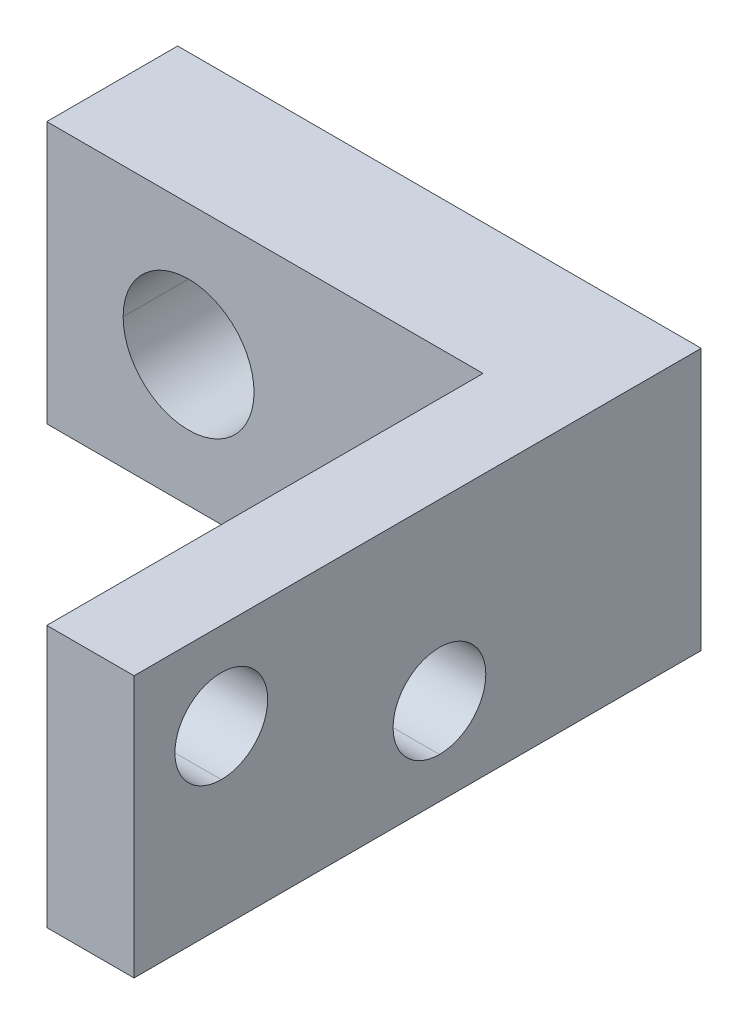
ISO-10303-21;
HEADER;
FILE_DESCRIPTION(('STEP AP214'),'2;1');
FILE_NAME('part.step','',(''),(''),'','','');
FILE_SCHEMA(('AUTOMOTIVE_DESIGN { 1 0 10303 214 1 1 1 1 }'));
ENDSEC;
DATA;
#1=APPLICATION_CONTEXT('core data for automotive mechanical design processes');
#2=APPLICATION_PROTOCOL_DEFINITION('international standard','automotive_design',2000,#1);
#3=PRODUCT_CONTEXT('',#1,'mechanical');
#4=PRODUCT('Part','Part','',(#3));
#5=PRODUCT_RELATED_PRODUCT_CATEGORY('part','',(#4));
#6=PRODUCT_DEFINITION_FORMATION('','',#4);
#7=PRODUCT_DEFINITION_CONTEXT('part definition',#1,'design');
#8=PRODUCT_DEFINITION('design','',#6,#7);
#9=PRODUCT_DEFINITION_SHAPE('','',#8);
#10=(LENGTH_UNIT() NAMED_UNIT(*) SI_UNIT(.MILLI.,.METRE.));
#11=(NAMED_UNIT(*) PLANE_ANGLE_UNIT() SI_UNIT($,.RADIAN.));
#12=(NAMED_UNIT(*) SI_UNIT($,.STERADIAN.) SOLID_ANGLE_UNIT());
#13=UNCERTAINTY_MEASURE_WITH_UNIT(LENGTH_MEASURE(1.E-05),#10,'distance_accuracy_value','');
#14=(GEOMETRIC_REPRESENTATION_CONTEXT(3) GLOBAL_UNCERTAINTY_ASSIGNED_CONTEXT((#13)) GLOBAL_UNIT_ASSIGNED_CONTEXT((#10,
#11,#12)) REPRESENTATION_CONTEXT('',''));
#15=CARTESIAN_POINT('',(0.,0.,0.));
#16=DIRECTION('',(0.,0.,1.));
#17=DIRECTION('',(1.,0.,0.));
#18=AXIS2_PLACEMENT_3D('',#15,#16,#17);
#19=CARTESIAN_POINT('',(-38.1,-19.05,-22.225));
#20=DIRECTION('',(0.,0.,1.));
#21=DIRECTION('',(1.,0.,0.));
#22=AXIS2_PLACEMENT_3D('',#19,#20,#21);
#23=PLANE('',#22);
#24=CARTESIAN_POINT('',(-17.4625,5.41433564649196E-13,-22.225));
#25=DIRECTION('',(0.,0.,1.));
#26=DIRECTION('',(1.,0.,0.));
#27=AXIS2_PLACEMENT_3D('',#24,#25,#26);
#28=CIRCLE('',#27,9.525);
#29=CARTESIAN_POINT('',(-26.9875,5.42600002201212E-13,-22.225));
#30=VERTEX_POINT('',#29);
#31=CARTESIAN_POINT('',(-7.9375,5.41433564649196E-13,-22.225));
#32=VERTEX_POINT('',#31);
#33=EDGE_CURVE('E19',#30,#32,#28,.F.);
#34=ORIENTED_EDGE('',*,*,#33,.T.);
#35=CARTESIAN_POINT('',(-17.4625,5.41433564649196E-13,-22.225));
#36=DIRECTION('',(0.,0.,1.));
#37=DIRECTION('',(1.,0.,0.));
#38=AXIS2_PLACEMENT_3D('',#35,#36,#37);
#39=CIRCLE('',#38,9.525);
#40=EDGE_CURVE('E103',#32,#30,#39,.F.);
#41=ORIENTED_EDGE('',*,*,#40,.T.);
#42=EDGE_LOOP('',(#34,#41));
#43=FACE_BOUND('',#42,.T.);
#44=DIRECTION('',(0.,1.,0.));
#45=VECTOR('',#44,1.);
#46=CARTESIAN_POINT('',(-38.1,-19.05,-22.225));
#47=LINE('',#46,#45);
#48=CARTESIAN_POINT('',(-38.1,-19.05,-22.225));
#49=VERTEX_POINT('',#48);
#50=CARTESIAN_POINT('',(-38.1,19.05,-22.225));
#51=VERTEX_POINT('',#50);
#52=EDGE_CURVE('E118',#49,#51,#47,.T.);
#53=ORIENTED_EDGE('',*,*,#52,.F.);
#54=DIRECTION('',(1.,0.,0.));
#55=VECTOR('',#54,1.);
#56=CARTESIAN_POINT('',(38.1,-19.05,-22.225));
#57=LINE('',#56,#55);
#58=CARTESIAN_POINT('',(25.4,-19.05,-22.225));
#59=VERTEX_POINT('',#58);
#60=EDGE_CURVE('E176',#59,#49,#57,.F.);
#61=ORIENTED_EDGE('',*,*,#60,.F.);
#62=DIRECTION('',(0.,1.,0.));
#63=VECTOR('',#62,1.);
#64=CARTESIAN_POINT('',(25.4,0.,-22.225));
#65=LINE('',#64,#63);
#66=CARTESIAN_POINT('',(25.4,19.05,-22.225));
#67=VERTEX_POINT('',#66);
#68=EDGE_CURVE('E109',#59,#67,#65,.T.);
#69=ORIENTED_EDGE('',*,*,#68,.T.);
#70=DIRECTION('',(1.,0.,0.));
#71=VECTOR('',#70,1.);
#72=CARTESIAN_POINT('',(38.1,19.05,-22.225));
#73=LINE('',#72,#71);
#74=EDGE_CURVE('E167',#67,#51,#73,.F.);
#75=ORIENTED_EDGE('',*,*,#74,.T.);
#76=EDGE_LOOP('',(#53,#61,#69,#75));
#77=FACE_BOUND('',#76,.T.);
#78=ADVANCED_FACE('F16',(#43,#77),#23,.T.);
#79=CARTESIAN_POINT('',(25.4,0.,-3.175));
#80=DIRECTION('',(1.,0.,0.));
#81=DIRECTION('',(0.,0.,-1.));
#82=AXIS2_PLACEMENT_3D('',#79,#80,#81);
#83=PLANE('',#82);
#84=ORIENTED_EDGE('',*,*,#68,.F.);
#85=DIRECTION('',(0.,0.,-1.));
#86=VECTOR('',#85,1.);
#87=CARTESIAN_POINT('',(25.4,-19.05,-41.275));
#88=LINE('',#87,#86);
#89=CARTESIAN_POINT('',(25.4,-19.05,41.275));
#90=VERTEX_POINT('',#89);
#91=EDGE_CURVE('E137',#90,#59,#88,.T.);
#92=ORIENTED_EDGE('',*,*,#91,.F.);
#93=DIRECTION('',(0.,1.,0.));
#94=VECTOR('',#93,1.);
#95=CARTESIAN_POINT('',(25.4,0.,41.275));
#96=LINE('',#95,#94);
#97=CARTESIAN_POINT('',(25.4,19.05,41.275));
#98=VERTEX_POINT('',#97);
#99=EDGE_CURVE('E174',#98,#90,#96,.F.);
#100=ORIENTED_EDGE('',*,*,#99,.F.);
#101=DIRECTION('',(0.,0.,-1.));
#102=VECTOR('',#101,1.);
#103=CARTESIAN_POINT('',(25.4,19.05,-41.275));
#104=LINE('',#103,#102);
#105=EDGE_CURVE('E163',#98,#67,#104,.T.);
#106=ORIENTED_EDGE('',*,*,#105,.T.);
#107=EDGE_LOOP('',(#84,#92,#100,#106));
#108=FACE_BOUND('',#107,.T.);
#109=CARTESIAN_POINT('',(25.4,6.34999999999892,28.575));
#110=DIRECTION('',(-1.,0.,0.));
#111=DIRECTION('',(0.,0.,1.));
#112=AXIS2_PLACEMENT_3D('',#109,#110,#111);
#113=CIRCLE('',#112,6.746875);
#114=CARTESIAN_POINT('',(25.4,13.0968749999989,28.575));
#115=VERTEX_POINT('',#114);
#116=CARTESIAN_POINT('',(25.4,-0.396875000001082,28.575));
#117=VERTEX_POINT('',#116);
#118=EDGE_CURVE('E129',#115,#117,#113,.F.);
#119=ORIENTED_EDGE('',*,*,#118,.T.);
#120=CARTESIAN_POINT('',(25.4,6.34999999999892,28.575));
#121=DIRECTION('',(-1.,0.,0.));
#122=DIRECTION('',(0.,0.,1.));
#123=AXIS2_PLACEMENT_3D('',#120,#121,#122);
#124=CIRCLE('',#123,6.746875);
#125=EDGE_CURVE('E131',#117,#115,#124,.F.);
#126=ORIENTED_EDGE('',*,*,#125,.T.);
#127=EDGE_LOOP('',(#119,#126));
#128=FACE_BOUND('',#127,.T.);
#129=CARTESIAN_POINT('',(25.4,-6.34999999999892,-3.175));
#130=DIRECTION('',(-1.,0.,0.));
#131=DIRECTION('',(0.,0.,1.));
#132=AXIS2_PLACEMENT_3D('',#129,#130,#131);
#133=CIRCLE('',#132,6.746875);
#134=CARTESIAN_POINT('',(25.4,0.396875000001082,-3.175));
#135=VERTEX_POINT('',#134);
#136=CARTESIAN_POINT('',(25.4,-13.0968749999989,-3.175));
#137=VERTEX_POINT('',#136);
#138=EDGE_CURVE('E124',#135,#137,#133,.F.);
#139=ORIENTED_EDGE('',*,*,#138,.T.);
#140=CARTESIAN_POINT('',(25.4,-6.34999999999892,-3.175));
#141=DIRECTION('',(-1.,0.,0.));
#142=DIRECTION('',(0.,0.,1.));
#143=AXIS2_PLACEMENT_3D('',#140,#141,#142);
#144=CIRCLE('',#143,6.746875);
#145=EDGE_CURVE('E126',#137,#135,#144,.F.);
#146=ORIENTED_EDGE('',*,*,#145,.T.);
#147=EDGE_LOOP('',(#139,#146));
#148=FACE_BOUND('',#147,.T.);
#149=ADVANCED_FACE('F207',(#108,#128,#148),#83,.F.);
#150=CARTESIAN_POINT('',(-17.4625,5.41433564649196E-13,-31.75));
#151=DIRECTION('',(0.,0.,1.));
#152=DIRECTION('',(1.,0.,0.));
#153=AXIS2_PLACEMENT_3D('',#150,#151,#152);
#154=CYLINDRICAL_SURFACE('',#153,9.525);
#155=ORIENTED_EDGE('',*,*,#33,.F.);
#156=DIRECTION('',(0.,0.,1.));
#157=VECTOR('',#156,1.);
#158=CARTESIAN_POINT('',(-26.9875,5.42600002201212E-13,-31.75));
#159=LINE('',#158,#157);
#160=CARTESIAN_POINT('',(-26.9875,5.42600002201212E-13,-41.275));
#161=VERTEX_POINT('',#160);
#162=EDGE_CURVE('E119',#30,#161,#159,.F.);
#163=ORIENTED_EDGE('',*,*,#162,.T.);
#164=CARTESIAN_POINT('',(-17.4625,5.41433564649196E-13,-41.275));
#165=DIRECTION('',(0.,0.,1.));
#166=DIRECTION('',(1.,0.,0.));
#167=AXIS2_PLACEMENT_3D('',#164,#165,#166);
#168=CIRCLE('',#167,9.525);
#169=CARTESIAN_POINT('',(-7.9375,5.41433564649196E-13,-41.275));
#170=VERTEX_POINT('',#169);
#171=EDGE_CURVE('E114',#161,#170,#168,.F.);
#172=ORIENTED_EDGE('',*,*,#171,.T.);
#173=DIRECTION('',(0.,0.,1.));
#174=VECTOR('',#173,1.);
#175=CARTESIAN_POINT('',(-7.9375,5.41433564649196E-13,-31.75));
#176=LINE('',#175,#174);
#177=EDGE_CURVE('E111',#170,#32,#176,.T.);
#178=ORIENTED_EDGE('',*,*,#177,.T.);
#179=EDGE_LOOP('',(#155,#163,#172,#178));
#180=FACE_BOUND('',#179,.T.);
#181=ADVANCED_FACE('F112',(#180),#154,.F.);
#182=CARTESIAN_POINT('',(-17.4625,5.41433564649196E-13,-31.75));
#183=DIRECTION('',(0.,0.,1.));
#184=DIRECTION('',(1.,0.,0.));
#185=AXIS2_PLACEMENT_3D('',#182,#183,#184);
#186=CYLINDRICAL_SURFACE('',#185,9.525);
#187=CARTESIAN_POINT('',(-17.4625,5.41433564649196E-13,-41.275));
#188=DIRECTION('',(0.,0.,1.));
#189=DIRECTION('',(1.,0.,0.));
#190=AXIS2_PLACEMENT_3D('',#187,#188,#189);
#191=CIRCLE('',#190,9.525);
#192=EDGE_CURVE('E136',#170,#161,#191,.F.);
#193=ORIENTED_EDGE('',*,*,#192,.T.);
#194=ORIENTED_EDGE('',*,*,#162,.F.);
#195=ORIENTED_EDGE('',*,*,#40,.F.);
#196=ORIENTED_EDGE('',*,*,#177,.F.);
#197=EDGE_LOOP('',(#193,#194,#195,#196));
#198=FACE_BOUND('',#197,.T.);
#199=ADVANCED_FACE('F121',(#198),#186,.F.);
#200=CARTESIAN_POINT('',(-38.1,-19.05,-41.275));
#201=DIRECTION('',(-1.,0.,0.));
#202=DIRECTION('',(0.,0.,1.));
#203=AXIS2_PLACEMENT_3D('',#200,#201,#202);
#204=PLANE('',#203);
#205=DIRECTION('',(0.,0.,-1.));
#206=VECTOR('',#205,1.);
#207=CARTESIAN_POINT('',(-38.1,-19.05,-41.275));
#208=LINE('',#207,#206);
#209=CARTESIAN_POINT('',(-38.1,-19.05,-41.275));
#210=VERTEX_POINT('',#209);
#211=EDGE_CURVE('E179',#49,#210,#208,.T.);
#212=ORIENTED_EDGE('',*,*,#211,.F.);
#213=ORIENTED_EDGE('',*,*,#52,.T.);
#214=DIRECTION('',(0.,0.,-1.));
#215=VECTOR('',#214,1.);
#216=CARTESIAN_POINT('',(-38.1,19.05,-41.275));
#217=LINE('',#216,#215);
#218=CARTESIAN_POINT('',(-38.1,19.05,-41.275));
#219=VERTEX_POINT('',#218);
#220=EDGE_CURVE('E169',#51,#219,#217,.T.);
#221=ORIENTED_EDGE('',*,*,#220,.T.);
#222=DIRECTION('',(0.,1.,0.));
#223=VECTOR('',#222,1.);
#224=CARTESIAN_POINT('',(-38.1,3.175,-41.275));
#225=LINE('',#224,#223);
#226=EDGE_CURVE('E139',#219,#210,#225,.F.);
#227=ORIENTED_EDGE('',*,*,#226,.T.);
#228=EDGE_LOOP('',(#212,#213,#221,#227));
#229=FACE_BOUND('',#228,.T.);
#230=ADVANCED_FACE('F220',(#229),#204,.T.);
#231=CARTESIAN_POINT('',(31.75,-6.34999999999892,-3.175));
#232=DIRECTION('',(-1.,0.,0.));
#233=DIRECTION('',(0.,0.,1.));
#234=AXIS2_PLACEMENT_3D('',#231,#232,#233);
#235=CYLINDRICAL_SURFACE('',#234,6.746875);
#236=ORIENTED_EDGE('',*,*,#138,.F.);
#237=DIRECTION('',(-1.,0.,0.));
#238=VECTOR('',#237,1.);
#239=CARTESIAN_POINT('',(31.75,0.396875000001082,-3.175));
#240=LINE('',#239,#238);
#241=CARTESIAN_POINT('',(38.1,0.396875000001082,-3.175));
#242=VERTEX_POINT('',#241);
#243=EDGE_CURVE('E128',#135,#242,#240,.F.);
#244=ORIENTED_EDGE('',*,*,#243,.T.);
#245=CARTESIAN_POINT('',(38.1,-6.34999999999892,-3.175));
#246=DIRECTION('',(-1.,0.,0.));
#247=DIRECTION('',(0.,0.,1.));
#248=AXIS2_PLACEMENT_3D('',#245,#246,#247);
#249=CIRCLE('',#248,6.746875);
#250=CARTESIAN_POINT('',(38.1,-13.0968749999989,-3.175));
#251=VERTEX_POINT('',#250);
#252=EDGE_CURVE('E140',#251,#242,#249,.T.);
#253=ORIENTED_EDGE('',*,*,#252,.F.);
#254=DIRECTION('',(-1.,0.,0.));
#255=VECTOR('',#254,1.);
#256=CARTESIAN_POINT('',(31.75,-13.0968749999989,-3.175));
#257=LINE('',#256,#255);
#258=EDGE_CURVE('E132',#251,#137,#257,.T.);
#259=ORIENTED_EDGE('',*,*,#258,.T.);
#260=EDGE_LOOP('',(#236,#244,#253,#259));
#261=FACE_BOUND('',#260,.T.);
#262=ADVANCED_FACE('F222',(#261),#235,.F.);
#263=CARTESIAN_POINT('',(31.75,-6.34999999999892,-3.175));
#264=DIRECTION('',(-1.,0.,0.));
#265=DIRECTION('',(0.,0.,1.));
#266=AXIS2_PLACEMENT_3D('',#263,#264,#265);
#267=CYLINDRICAL_SURFACE('',#266,6.746875);
#268=CARTESIAN_POINT('',(38.1,-6.34999999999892,-3.175));
#269=DIRECTION('',(-1.,0.,0.));
#270=DIRECTION('',(0.,0.,1.));
#271=AXIS2_PLACEMENT_3D('',#268,#269,#270);
#272=CIRCLE('',#271,6.746875);
#273=EDGE_CURVE('E143',#242,#251,#272,.T.);
#274=ORIENTED_EDGE('',*,*,#273,.F.);
#275=ORIENTED_EDGE('',*,*,#243,.F.);
#276=ORIENTED_EDGE('',*,*,#145,.F.);
#277=ORIENTED_EDGE('',*,*,#258,.F.);
#278=EDGE_LOOP('',(#274,#275,#276,#277));
#279=FACE_BOUND('',#278,.T.);
#280=ADVANCED_FACE('F229',(#279),#267,.F.);
#281=CARTESIAN_POINT('',(31.75,6.34999999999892,28.575));
#282=DIRECTION('',(-1.,0.,0.));
#283=DIRECTION('',(0.,0.,1.));
#284=AXIS2_PLACEMENT_3D('',#281,#282,#283);
#285=CYLINDRICAL_SURFACE('',#284,6.746875);
#286=ORIENTED_EDGE('',*,*,#118,.F.);
#287=DIRECTION('',(-1.,0.,0.));
#288=VECTOR('',#287,1.);
#289=CARTESIAN_POINT('',(31.75,13.0968749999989,28.575));
#290=LINE('',#289,#288);
#291=CARTESIAN_POINT('',(38.1,13.0968749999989,28.575));
#292=VERTEX_POINT('',#291);
#293=EDGE_CURVE('E134',#115,#292,#290,.F.);
#294=ORIENTED_EDGE('',*,*,#293,.T.);
#295=CARTESIAN_POINT('',(38.1,6.34999999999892,28.575));
#296=DIRECTION('',(-1.,0.,0.));
#297=DIRECTION('',(0.,0.,1.));
#298=AXIS2_PLACEMENT_3D('',#295,#296,#297);
#299=CIRCLE('',#298,6.746875);
#300=CARTESIAN_POINT('',(38.1,-0.396875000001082,28.575));
#301=VERTEX_POINT('',#300);
#302=EDGE_CURVE('E147',#301,#292,#299,.T.);
#303=ORIENTED_EDGE('',*,*,#302,.F.);
#304=DIRECTION('',(-1.,0.,0.));
#305=VECTOR('',#304,1.);
#306=CARTESIAN_POINT('',(31.75,-0.396875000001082,28.575));
#307=LINE('',#306,#305);
#308=EDGE_CURVE('E160',#301,#117,#307,.T.);
#309=ORIENTED_EDGE('',*,*,#308,.T.);
#310=EDGE_LOOP('',(#286,#294,#303,#309));
#311=FACE_BOUND('',#310,.T.);
#312=ADVANCED_FACE('F249',(#311),#285,.F.);
#313=CARTESIAN_POINT('',(31.75,6.34999999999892,28.575));
#314=DIRECTION('',(-1.,0.,0.));
#315=DIRECTION('',(0.,0.,1.));
#316=AXIS2_PLACEMENT_3D('',#313,#314,#315);
#317=CYLINDRICAL_SURFACE('',#316,6.746875);
#318=CARTESIAN_POINT('',(38.1,6.34999999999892,28.575));
#319=DIRECTION('',(-1.,0.,0.));
#320=DIRECTION('',(0.,0.,1.));
#321=AXIS2_PLACEMENT_3D('',#318,#319,#320);
#322=CIRCLE('',#321,6.746875);
#323=EDGE_CURVE('E150',#292,#301,#322,.T.);
#324=ORIENTED_EDGE('',*,*,#323,.F.);
#325=ORIENTED_EDGE('',*,*,#293,.F.);
#326=ORIENTED_EDGE('',*,*,#125,.F.);
#327=ORIENTED_EDGE('',*,*,#308,.F.);
#328=EDGE_LOOP('',(#324,#325,#326,#327));
#329=FACE_BOUND('',#328,.T.);
#330=ADVANCED_FACE('F246',(#329),#317,.F.);
#331=CARTESIAN_POINT('',(38.1,19.05,-41.275));
#332=DIRECTION('',(0.,-1.,0.));
#333=DIRECTION('',(0.,0.,-1.));
#334=AXIS2_PLACEMENT_3D('',#331,#332,#333);
#335=PLANE('',#334);
#336=DIRECTION('',(1.,0.,0.));
#337=VECTOR('',#336,1.);
#338=CARTESIAN_POINT('',(0.,19.05,-41.275));
#339=LINE('',#338,#337);
#340=CARTESIAN_POINT('',(38.1,19.05,-41.275));
#341=VERTEX_POINT('',#340);
#342=EDGE_CURVE('E144',#341,#219,#339,.F.);
#343=ORIENTED_EDGE('',*,*,#342,.T.);
#344=ORIENTED_EDGE('',*,*,#220,.F.);
#345=ORIENTED_EDGE('',*,*,#74,.F.);
#346=ORIENTED_EDGE('',*,*,#105,.F.);
#347=DIRECTION('',(1.,0.,0.));
#348=VECTOR('',#347,1.);
#349=CARTESIAN_POINT('',(31.75,19.05,41.275));
#350=LINE('',#349,#348);
#351=CARTESIAN_POINT('',(38.1,19.05,41.275));
#352=VERTEX_POINT('',#351);
#353=EDGE_CURVE('E171',#352,#98,#350,.F.);
#354=ORIENTED_EDGE('',*,*,#353,.F.);
#355=DIRECTION('',(0.,0.,-1.));
#356=VECTOR('',#355,1.);
#357=CARTESIAN_POINT('',(38.1,19.05,-41.275));
#358=LINE('',#357,#356);
#359=EDGE_CURVE('E153',#341,#352,#358,.F.);
#360=ORIENTED_EDGE('',*,*,#359,.F.);
#361=EDGE_LOOP('',(#343,#344,#345,#346,#354,#360));
#362=FACE_BOUND('',#361,.T.);
#363=ADVANCED_FACE('F219',(#362),#335,.F.);
#364=CARTESIAN_POINT('',(31.75,0.,41.275));
#365=DIRECTION('',(0.,0.,1.));
#366=DIRECTION('',(1.,0.,0.));
#367=AXIS2_PLACEMENT_3D('',#364,#365,#366);
#368=PLANE('',#367);
#369=ORIENTED_EDGE('',*,*,#99,.T.);
#370=DIRECTION('',(1.,0.,0.));
#371=VECTOR('',#370,1.);
#372=CARTESIAN_POINT('',(38.1,-19.05,41.275));
#373=LINE('',#372,#371);
#374=CARTESIAN_POINT('',(38.1,-19.05,41.275));
#375=VERTEX_POINT('',#374);
#376=EDGE_CURVE('E181',#375,#90,#373,.F.);
#377=ORIENTED_EDGE('',*,*,#376,.F.);
#378=DIRECTION('',(0.,1.,0.));
#379=VECTOR('',#378,1.);
#380=CARTESIAN_POINT('',(38.1,25.4,41.275));
#381=LINE('',#380,#379);
#382=EDGE_CURVE('E192',#352,#375,#381,.F.);
#383=ORIENTED_EDGE('',*,*,#382,.F.);
#384=ORIENTED_EDGE('',*,*,#353,.T.);
#385=EDGE_LOOP('',(#369,#377,#383,#384));
#386=FACE_BOUND('',#385,.T.);
#387=ADVANCED_FACE('F203',(#386),#368,.T.);
#388=CARTESIAN_POINT('',(38.1,-19.05,-41.275));
#389=DIRECTION('',(0.,-1.,0.));
#390=DIRECTION('',(0.,0.,-1.));
#391=AXIS2_PLACEMENT_3D('',#388,#389,#390);
#392=PLANE('',#391);
#393=ORIENTED_EDGE('',*,*,#376,.T.);
#394=ORIENTED_EDGE('',*,*,#91,.T.);
#395=ORIENTED_EDGE('',*,*,#60,.T.);
#396=ORIENTED_EDGE('',*,*,#211,.T.);
#397=DIRECTION('',(1.,0.,0.));
#398=VECTOR('',#397,1.);
#399=CARTESIAN_POINT('',(0.,-19.05,-41.275));
#400=LINE('',#399,#398);
#401=CARTESIAN_POINT('',(38.1,-19.05,-41.275));
#402=VERTEX_POINT('',#401);
#403=EDGE_CURVE('E34',#210,#402,#400,.T.);
#404=ORIENTED_EDGE('',*,*,#403,.T.);
#405=DIRECTION('',(0.,0.,-1.));
#406=VECTOR('',#405,1.);
#407=CARTESIAN_POINT('',(38.1,-19.05,-41.275));
#408=LINE('',#407,#406);
#409=EDGE_CURVE('E25',#375,#402,#408,.T.);
#410=ORIENTED_EDGE('',*,*,#409,.F.);
#411=EDGE_LOOP('',(#393,#394,#395,#396,#404,#410));
#412=FACE_BOUND('',#411,.T.);
#413=ADVANCED_FACE('F200',(#412),#392,.T.);
#414=CARTESIAN_POINT('',(0.,3.175,-41.275));
#415=DIRECTION('',(0.,0.,1.));
#416=DIRECTION('',(1.,0.,0.));
#417=AXIS2_PLACEMENT_3D('',#414,#415,#416);
#418=PLANE('',#417);
#419=DIRECTION('',(0.,1.,0.));
#420=VECTOR('',#419,1.);
#421=CARTESIAN_POINT('',(38.1,25.4,-41.275));
#422=LINE('',#421,#420);
#423=EDGE_CURVE('E11',#402,#341,#422,.T.);
#424=ORIENTED_EDGE('',*,*,#423,.F.);
#425=ORIENTED_EDGE('',*,*,#403,.F.);
#426=ORIENTED_EDGE('',*,*,#226,.F.);
#427=ORIENTED_EDGE('',*,*,#342,.F.);
#428=EDGE_LOOP('',(#424,#425,#426,#427));
#429=FACE_BOUND('',#428,.T.);
#430=ORIENTED_EDGE('',*,*,#171,.F.);
#431=ORIENTED_EDGE('',*,*,#192,.F.);
#432=EDGE_LOOP('',(#430,#431));
#433=FACE_BOUND('',#432,.T.);
#434=ADVANCED_FACE('F214',(#429,#433),#418,.F.);
#435=CARTESIAN_POINT('',(38.1,25.4,-41.275));
#436=DIRECTION('',(1.,0.,0.));
#437=DIRECTION('',(0.,0.,-1.));
#438=AXIS2_PLACEMENT_3D('',#435,#436,#437);
#439=PLANE('',#438);
#440=ORIENTED_EDGE('',*,*,#409,.T.);
#441=ORIENTED_EDGE('',*,*,#423,.T.);
#442=ORIENTED_EDGE('',*,*,#359,.T.);
#443=ORIENTED_EDGE('',*,*,#382,.T.);
#444=EDGE_LOOP('',(#440,#441,#442,#443));
#445=FACE_BOUND('',#444,.T.);
#446=ORIENTED_EDGE('',*,*,#302,.T.);
#447=ORIENTED_EDGE('',*,*,#323,.T.);
#448=EDGE_LOOP('',(#446,#447));
#449=FACE_BOUND('',#448,.T.);
#450=ORIENTED_EDGE('',*,*,#252,.T.);
#451=ORIENTED_EDGE('',*,*,#273,.T.);
#452=EDGE_LOOP('',(#450,#451));
#453=FACE_BOUND('',#452,.T.);
#454=ADVANCED_FACE('F197',(#445,#449,#453),#439,.T.);
#455=CLOSED_SHELL('',(#78,#149,#181,#199,#230,#262,#280,#312,#330,#363,#387,#413,#434,#454));
#456=MANIFOLD_SOLID_BREP('B1',#455);
#457=ADVANCED_BREP_SHAPE_REPRESENTATION('',(#18,#456),#14);
#458=SHAPE_DEFINITION_REPRESENTATION(#9,#457);
ENDSEC;
END-ISO-10303-21;
